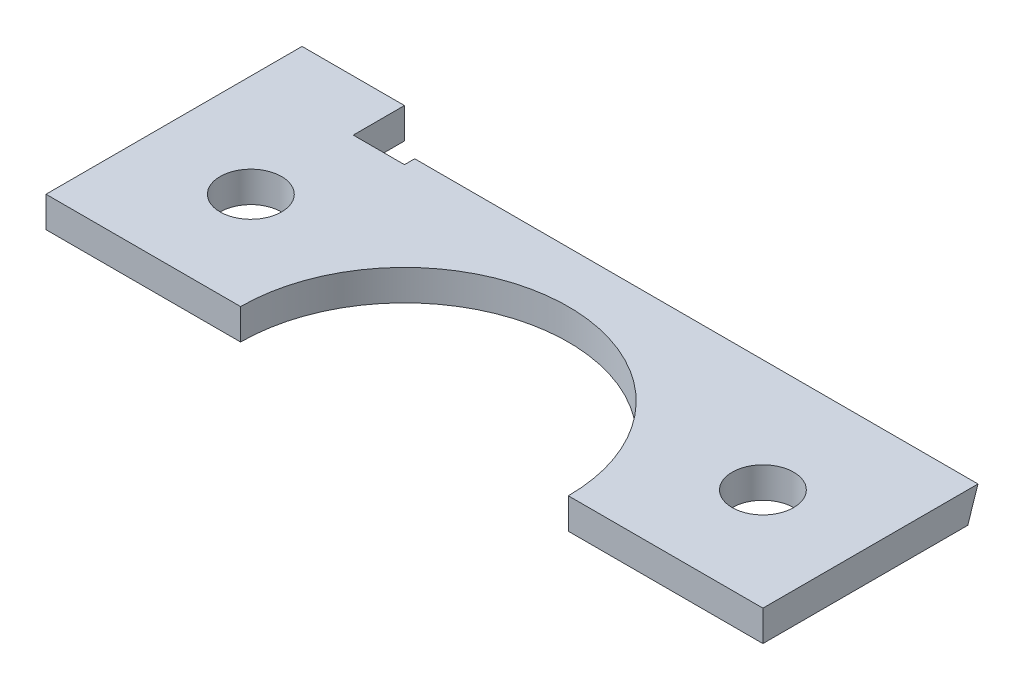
from build123d import *

# Parameters (mm, degrees)
SKETCH1_R          = 3
EXTRUDE1_DEPTH     = 3
CUT_EXTRUDE1_DEPTH = 55


with BuildPart() as part:
    # Sketch1 → Extrude1 (new body)
    with BuildSketch(Plane(origin=(0, 0, 0), x_dir=(1, 0, 0), z_dir=(0, 1, 0))):
        with BuildLine():
            Line((10, 20), (10, 25))
            Line((10, 25), (0, 25))
            Line((0, 25), (0, 0))
            Line((0, 0), (19, 0))
            ThreePointArc((19, 0), (35, 16), (51, 0))
            Line((51, 0), (70, 0))
            Line((70, 0), (70, 21))
            Line((70, 21), (15, 21))
            Line((15, 21), (15, 20))
            Line((15, 20), (10, 20))
        make_face()
        with Locations(Location((10, 10, 0), (0, 0, 270))):
            Circle(SKETCH1_R, mode=Mode.SUBTRACT)
        with Locations(Location((60, 10, 0), (0, 0, 270))):
            Circle(SKETCH1_R, mode=Mode.SUBTRACT)
    extrude(amount=EXTRUDE1_DEPTH)

    # Sketch2 → Cut-Extrude1 (cut)
    with BuildSketch(Plane(origin=(70, 0, 0), x_dir=(0, 0, -1), z_dir=(1, 0, 0))):
        Polygon((21, 3), (21, 0), (20, 0), align=None)
    extrude(amount=-CUT_EXTRUDE1_DEPTH, mode=Mode.SUBTRACT)


solid = part.part
